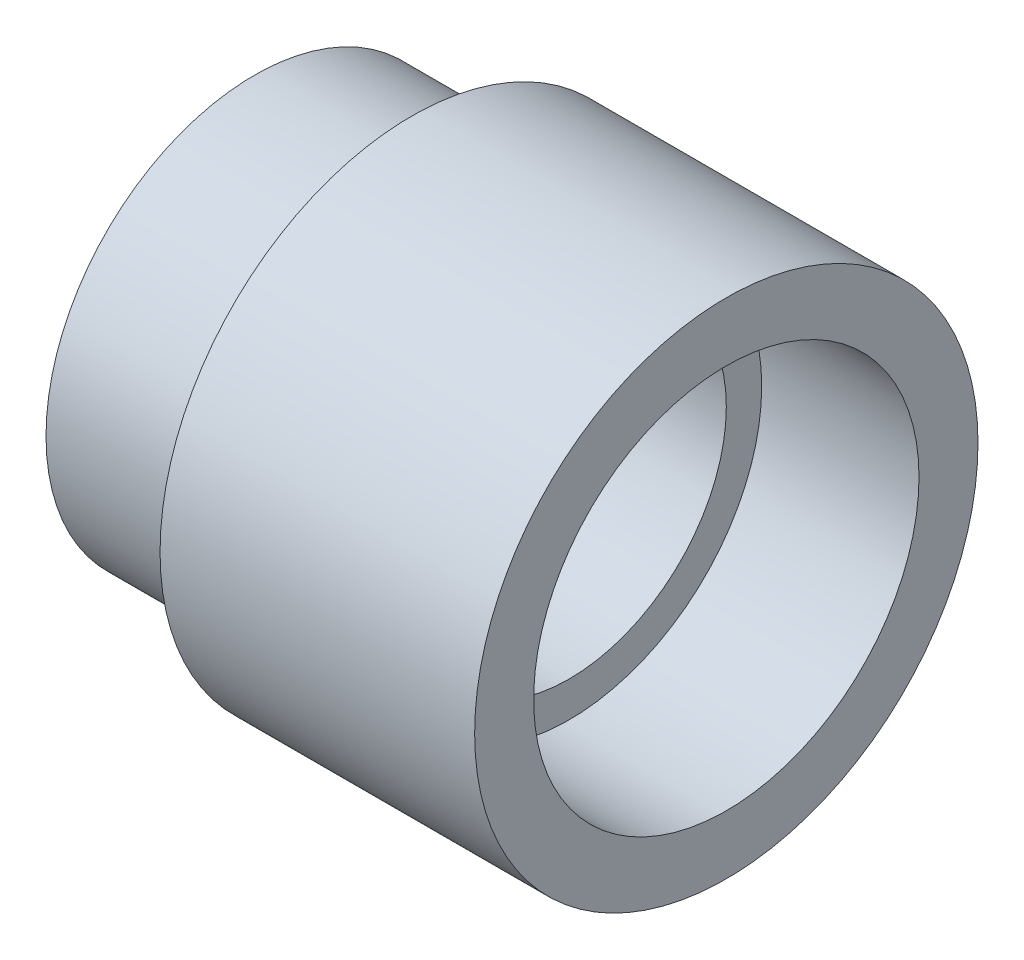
ISO-10303-21;
HEADER;
FILE_DESCRIPTION(('STEP AP214'),'2;1');
FILE_NAME('part.step','',(''),(''),'','','');
FILE_SCHEMA(('AUTOMOTIVE_DESIGN { 1 0 10303 214 1 1 1 1 }'));
ENDSEC;
DATA;
#1=APPLICATION_CONTEXT('core data for automotive mechanical design processes');
#2=APPLICATION_PROTOCOL_DEFINITION('international standard','automotive_design',2000,#1);
#3=PRODUCT_CONTEXT('',#1,'mechanical');
#4=PRODUCT('Part','Part','',(#3));
#5=PRODUCT_RELATED_PRODUCT_CATEGORY('part','',(#4));
#6=PRODUCT_DEFINITION_FORMATION('','',#4);
#7=PRODUCT_DEFINITION_CONTEXT('part definition',#1,'design');
#8=PRODUCT_DEFINITION('design','',#6,#7);
#9=PRODUCT_DEFINITION_SHAPE('','',#8);
#10=(LENGTH_UNIT() NAMED_UNIT(*) SI_UNIT(.MILLI.,.METRE.));
#11=(NAMED_UNIT(*) PLANE_ANGLE_UNIT() SI_UNIT($,.RADIAN.));
#12=(NAMED_UNIT(*) SI_UNIT($,.STERADIAN.) SOLID_ANGLE_UNIT());
#13=UNCERTAINTY_MEASURE_WITH_UNIT(LENGTH_MEASURE(1.E-05),#10,'distance_accuracy_value','');
#14=(GEOMETRIC_REPRESENTATION_CONTEXT(3) GLOBAL_UNCERTAINTY_ASSIGNED_CONTEXT((#13)) GLOBAL_UNIT_ASSIGNED_CONTEXT((#10,
#11,#12)) REPRESENTATION_CONTEXT('',''));
#15=CARTESIAN_POINT('',(0.,0.,0.));
#16=DIRECTION('',(0.,0.,1.));
#17=DIRECTION('',(1.,0.,0.));
#18=AXIS2_PLACEMENT_3D('',#15,#16,#17);
#19=CARTESIAN_POINT('',(-73.5094124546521,0.,0.));
#20=DIRECTION('',(-1.,0.,0.));
#21=DIRECTION('',(0.,0.,1.));
#22=AXIS2_PLACEMENT_3D('',#19,#20,#21);
#23=CYLINDRICAL_SURFACE('',#22,10.);
#24=CARTESIAN_POINT('',(0.,0.,0.));
#25=DIRECTION('',(-1.,0.,0.));
#26=DIRECTION('',(0.,0.,1.));
#27=AXIS2_PLACEMENT_3D('',#24,#25,#26);
#28=CIRCLE('',#27,10.);
#29=CARTESIAN_POINT('',(0.,0.,10.));
#30=VERTEX_POINT('',#29);
#31=EDGE_CURVE('E42',#30,#30,#28,.T.);
#32=ORIENTED_EDGE('',*,*,#31,.T.);
#33=EDGE_LOOP('',(#32));
#34=FACE_BOUND('',#33,.T.);
#35=CARTESIAN_POINT('',(20.,0.,0.));
#36=DIRECTION('',(1.,0.,0.));
#37=DIRECTION('',(0.,0.,-1.));
#38=AXIS2_PLACEMENT_3D('',#35,#36,#37);
#39=CIRCLE('',#38,10.);
#40=CARTESIAN_POINT('',(20.,0.,-10.));
#41=VERTEX_POINT('',#40);
#42=EDGE_CURVE('E38',#41,#41,#39,.F.);
#43=ORIENTED_EDGE('',*,*,#42,.F.);
#44=EDGE_LOOP('',(#43));
#45=FACE_BOUND('',#44,.T.);
#46=ADVANCED_FACE('F34',(#34,#45),#23,.F.);
#47=CARTESIAN_POINT('',(0.,10.,0.));
#48=DIRECTION('',(1.,0.,0.));
#49=DIRECTION('',(0.,0.,-1.));
#50=AXIS2_PLACEMENT_3D('',#47,#48,#49);
#51=PLANE('',#50);
#52=ORIENTED_EDGE('',*,*,#31,.F.);
#53=EDGE_LOOP('',(#52));
#54=FACE_BOUND('',#53,.T.);
#55=CARTESIAN_POINT('',(0.,0.,0.));
#56=DIRECTION('',(-1.,0.,0.));
#57=DIRECTION('',(0.,0.,1.));
#58=AXIS2_PLACEMENT_3D('',#55,#56,#57);
#59=CIRCLE('',#58,13.25);
#60=CARTESIAN_POINT('',(0.,0.,13.25));
#61=VERTEX_POINT('',#60);
#62=EDGE_CURVE('E52',#61,#61,#59,.T.);
#63=ORIENTED_EDGE('',*,*,#62,.T.);
#64=EDGE_LOOP('',(#63));
#65=FACE_BOUND('',#64,.T.);
#66=ADVANCED_FACE('F36',(#54,#65),#51,.F.);
#67=CARTESIAN_POINT('',(-73.5094124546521,0.,0.));
#68=DIRECTION('',(-1.,0.,0.));
#69=DIRECTION('',(0.,0.,1.));
#70=AXIS2_PLACEMENT_3D('',#67,#68,#69);
#71=CYLINDRICAL_SURFACE('',#70,16.);
#72=CARTESIAN_POINT('',(30.,0.,0.));
#73=DIRECTION('',(-1.,0.,0.));
#74=DIRECTION('',(0.,0.,1.));
#75=AXIS2_PLACEMENT_3D('',#72,#73,#74);
#76=CIRCLE('',#75,16.);
#77=CARTESIAN_POINT('',(30.,0.,16.));
#78=VERTEX_POINT('',#77);
#79=EDGE_CURVE('E10',#78,#78,#76,.T.);
#80=ORIENTED_EDGE('',*,*,#79,.T.);
#81=EDGE_LOOP('',(#80));
#82=FACE_BOUND('',#81,.T.);
#83=CARTESIAN_POINT('',(10.,0.,0.));
#84=DIRECTION('',(-1.,0.,0.));
#85=DIRECTION('',(0.,0.,1.));
#86=AXIS2_PLACEMENT_3D('',#83,#84,#85);
#87=CIRCLE('',#86,16.);
#88=CARTESIAN_POINT('',(10.,0.,16.));
#89=VERTEX_POINT('',#88);
#90=EDGE_CURVE('E46',#89,#89,#87,.T.);
#91=ORIENTED_EDGE('',*,*,#90,.F.);
#92=EDGE_LOOP('',(#91));
#93=FACE_BOUND('',#92,.T.);
#94=ADVANCED_FACE('F77',(#82,#93),#71,.T.);
#95=CARTESIAN_POINT('',(30.,10.,0.));
#96=DIRECTION('',(-1.,0.,0.));
#97=DIRECTION('',(0.,0.,1.));
#98=AXIS2_PLACEMENT_3D('',#95,#96,#97);
#99=PLANE('',#98);
#100=CARTESIAN_POINT('',(30.,0.,0.));
#101=DIRECTION('',(1.,0.,0.));
#102=DIRECTION('',(0.,0.,-1.));
#103=AXIS2_PLACEMENT_3D('',#100,#101,#102);
#104=CIRCLE('',#103,12.25);
#105=CARTESIAN_POINT('',(30.,0.,-12.25));
#106=VERTEX_POINT('',#105);
#107=EDGE_CURVE('E57',#106,#106,#104,.T.);
#108=ORIENTED_EDGE('',*,*,#107,.F.);
#109=EDGE_LOOP('',(#108));
#110=FACE_BOUND('',#109,.T.);
#111=ORIENTED_EDGE('',*,*,#79,.F.);
#112=EDGE_LOOP('',(#111));
#113=FACE_BOUND('',#112,.T.);
#114=ADVANCED_FACE('F83',(#110,#113),#99,.F.);
#115=CARTESIAN_POINT('',(10.,0.,0.));
#116=DIRECTION('',(-1.,0.,0.));
#117=DIRECTION('',(0.,0.,1.));
#118=AXIS2_PLACEMENT_3D('',#115,#116,#117);
#119=PLANE('',#118);
#120=CARTESIAN_POINT('',(10.,0.,0.));
#121=DIRECTION('',(-1.,0.,0.));
#122=DIRECTION('',(0.,0.,1.));
#123=AXIS2_PLACEMENT_3D('',#120,#121,#122);
#124=CIRCLE('',#123,13.25);
#125=CARTESIAN_POINT('',(10.,0.,13.25));
#126=VERTEX_POINT('',#125);
#127=EDGE_CURVE('E51',#126,#126,#124,.T.);
#128=ORIENTED_EDGE('',*,*,#127,.F.);
#129=EDGE_LOOP('',(#128));
#130=FACE_BOUND('',#129,.T.);
#131=ORIENTED_EDGE('',*,*,#90,.T.);
#132=EDGE_LOOP('',(#131));
#133=FACE_BOUND('',#132,.T.);
#134=ADVANCED_FACE('F81',(#130,#133),#119,.T.);
#135=CARTESIAN_POINT('',(10.,0.,0.));
#136=DIRECTION('',(-1.,0.,0.));
#137=DIRECTION('',(0.,0.,1.));
#138=AXIS2_PLACEMENT_3D('',#135,#136,#137);
#139=CYLINDRICAL_SURFACE('',#138,13.25);
#140=ORIENTED_EDGE('',*,*,#127,.T.);
#141=EDGE_LOOP('',(#140));
#142=FACE_BOUND('',#141,.T.);
#143=ORIENTED_EDGE('',*,*,#62,.F.);
#144=EDGE_LOOP('',(#143));
#145=FACE_BOUND('',#144,.T.);
#146=ADVANCED_FACE('F93',(#142,#145),#139,.T.);
#147=CARTESIAN_POINT('',(20.,0.,0.));
#148=DIRECTION('',(1.,0.,0.));
#149=DIRECTION('',(0.,0.,-1.));
#150=AXIS2_PLACEMENT_3D('',#147,#148,#149);
#151=PLANE('',#150);
#152=CARTESIAN_POINT('',(20.,0.,0.));
#153=DIRECTION('',(1.,0.,0.));
#154=DIRECTION('',(0.,0.,-1.));
#155=AXIS2_PLACEMENT_3D('',#152,#153,#154);
#156=CIRCLE('',#155,12.25);
#157=CARTESIAN_POINT('',(20.,0.,-12.25));
#158=VERTEX_POINT('',#157);
#159=EDGE_CURVE('E60',#158,#158,#156,.T.);
#160=ORIENTED_EDGE('',*,*,#159,.T.);
#161=EDGE_LOOP('',(#160));
#162=FACE_BOUND('',#161,.T.);
#163=ORIENTED_EDGE('',*,*,#42,.T.);
#164=EDGE_LOOP('',(#163));
#165=FACE_BOUND('',#164,.T.);
#166=ADVANCED_FACE('F67',(#162,#165),#151,.T.);
#167=CARTESIAN_POINT('',(20.,0.,0.));
#168=DIRECTION('',(1.,0.,0.));
#169=DIRECTION('',(0.,0.,-1.));
#170=AXIS2_PLACEMENT_3D('',#167,#168,#169);
#171=CYLINDRICAL_SURFACE('',#170,12.25);
#172=ORIENTED_EDGE('',*,*,#159,.F.);
#173=EDGE_LOOP('',(#172));
#174=FACE_BOUND('',#173,.T.);
#175=ORIENTED_EDGE('',*,*,#107,.T.);
#176=EDGE_LOOP('',(#175));
#177=FACE_BOUND('',#176,.T.);
#178=ADVANCED_FACE('F107',(#174,#177),#171,.F.);
#179=CLOSED_SHELL('',(#46,#66,#94,#114,#134,#146,#166,#178));
#180=MANIFOLD_SOLID_BREP('B2',#179);
#181=ADVANCED_BREP_SHAPE_REPRESENTATION('',(#18,#180),#14);
#182=SHAPE_DEFINITION_REPRESENTATION(#9,#181);
ENDSEC;
END-ISO-10303-21;
